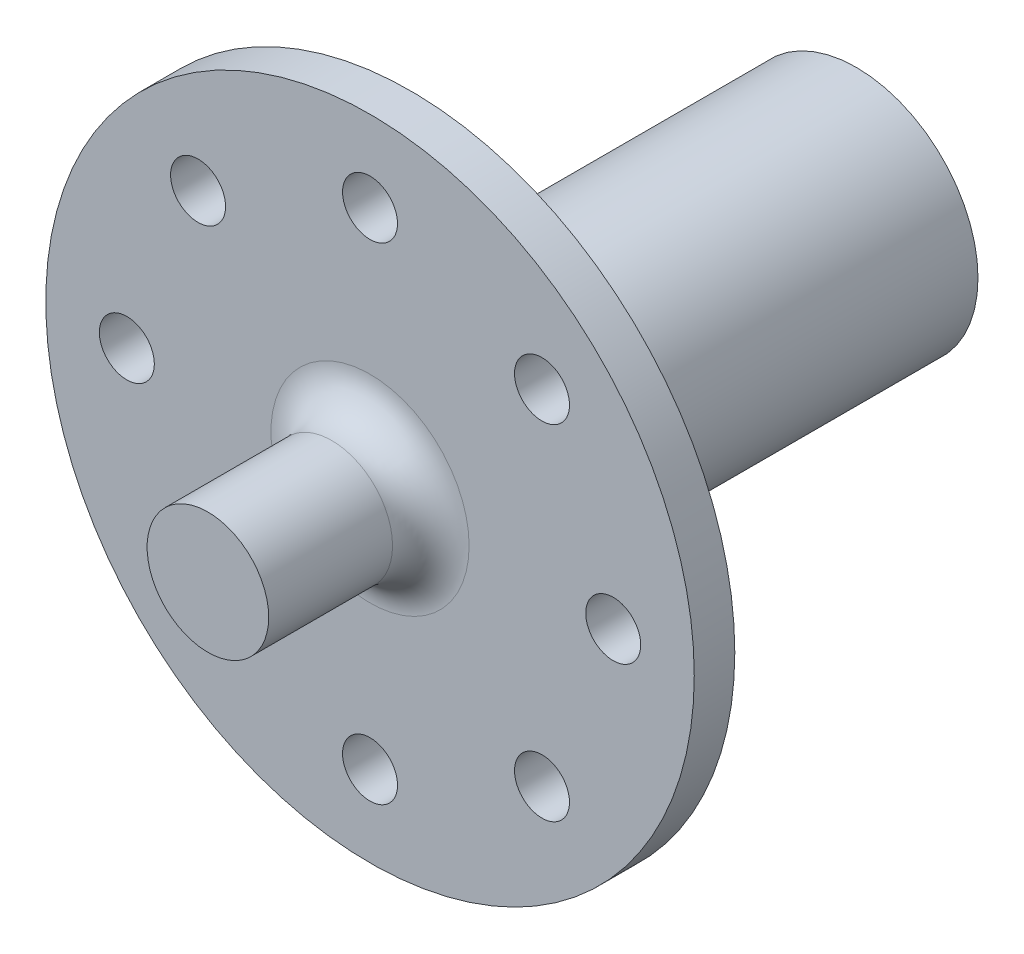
from build123d import *

# Parameters (mm, degrees)
SKETCH1_R                                       = 9.525
BOSS_EXTRUDE1_DEPTH                             = 34.925
SKETCH2_R                                       = 25.4
BOSS_EXTRUDE2_DEPTH                             = 3.175
SKETCH3_R                                       = 4.7625
BOSS_EXTRUDE3_DEPTH                             = 12.7
SKETCH4_R                                       = 2.15265
CUT_EXTRUDE1_DEPTH                              = 19.05
CIRPATTERN1_COUNT                               = 8
FILLET1_R                                       = 3
F_16_6MMFORKEYWAYDEPTHAND_6MMFOREXTRA_375_DEPTH = 17.1500038


with BuildPart() as part:
    # Sketch1 → Boss-Extrude1 (new body)
    with BuildSketch(Plane.XY):
        Circle(SKETCH1_R)
    extrude(amount=BOSS_EXTRUDE1_DEPTH)

    # Sketch2 → Boss-Extrude2 (add)
    with BuildSketch(Plane.XY.offset(34.925)):
        Circle(SKETCH2_R)
    extrude(amount=BOSS_EXTRUDE2_DEPTH)

    # Sketch3 → Boss-Extrude3 (add)
    with BuildSketch(Plane.XY.offset(38.1)):
        Circle(SKETCH3_R)
    extrude(amount=BOSS_EXTRUDE3_DEPTH)

    # Sketch4 → Cut-Extrude1 (cut)
    with BuildSketch(Plane.XY.offset(38.1)):
        with Locations((0, 19.05)):
            Circle(SKETCH4_R)
    cut_extrude1 = extrude(amount=-CUT_EXTRUDE1_DEPTH, mode=Mode.SUBTRACT)

    # CirPattern1: Cut-Extrude1 ×8 about axis
    cirpattern1_axis = Axis((0, 0, 0), (0, 0, 1))
    for i in range(1, CIRPATTERN1_COUNT):
        add(cut_extrude1.rotate(cirpattern1_axis, i * 360 / CIRPATTERN1_COUNT), mode=Mode.SUBTRACT)

    # Fillet1
    fillet1_edges = [part.edges().sort_by_distance(p)[0] for p in [
        (-4.7625, 0, 38.1),
    ]]
    fillet(fillet1_edges, radius=FILLET1_R)

    # Sketch5 → 16.6mmForKeywayDepthand.6mmForExtra.375 (cut)
    with BuildSketch(Plane(origin=(0, 0, 0), x_dir=(-1, 0, 0), z_dir=(0, 0, -1))):
        with BuildLine():
            Line((-1.5, 5.2), (1.5, 5.2))
            Line((1.5, 5.2), (1.5, 3.708099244))
            ThreePointArc((1.5, 3.708099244), (0, -4), (-1.5, 3.708099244))
            Line((-1.5, 3.708099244), (-1.5, 5.2))
        make_face()
    extrude(amount=-F_16_6MMFORKEYWAYDEPTHAND_6MMFOREXTRA_375_DEPTH, mode=Mode.SUBTRACT)


solid = part.part
